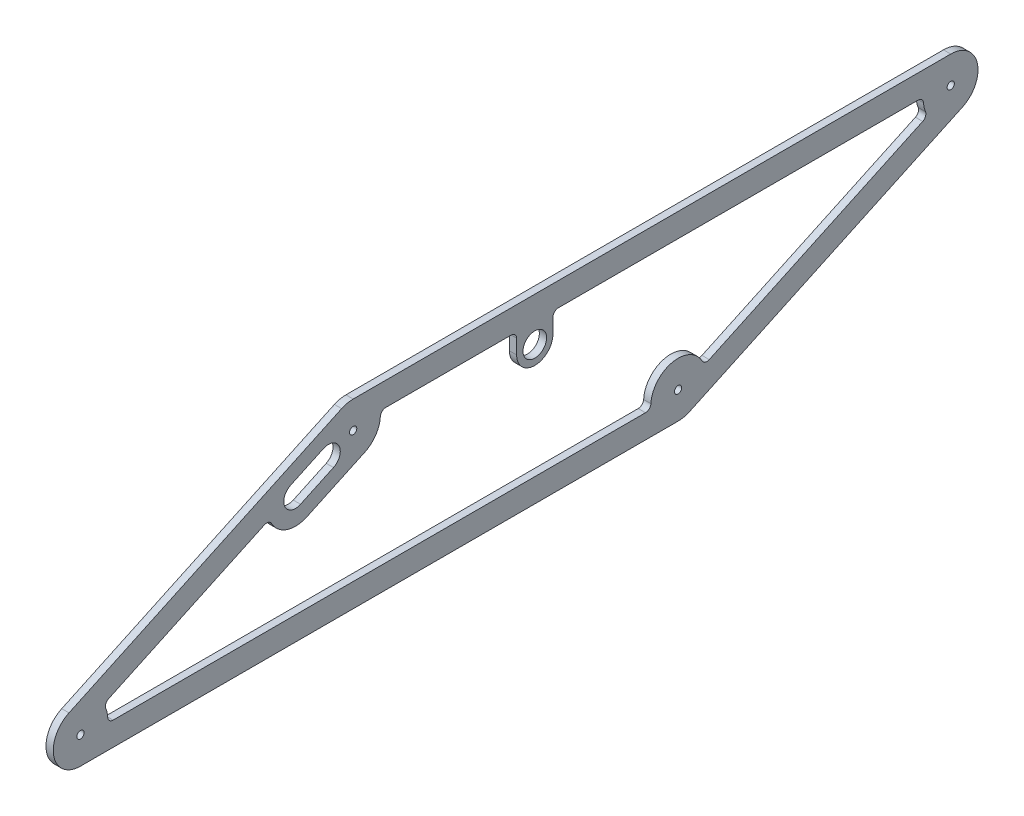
from build123d import *

# Parameters (mm, degrees)
BOSS_EXTRUDE1_DEPTH = 4
SKETCH2_R           = 2
CUT_EXTRUDE1_DEPTH  = 34
SKETCH3_R           = 2
CUT_EXTRUDE2_DEPTH  = 34
CUT_EXTRUDE3_START  = -34
CUT_EXTRUDE3_DEPTH  = 34
SKETCH8_R           = 10
BOSS_EXTRUDE3_DEPTH = 4
SKETCH5_R           = 6.5
CUT_EXTRUDE5_DEPTH  = 4
BOSS_EXTRUDE4_START = -4
BOSS_EXTRUDE4_DEPTH = 4
CUT_EXTRUDE6_DEPTH  = 4
SKETCH11_R          = 2
CUT_EXTRUDE7_DEPTH  = 10
FILLET1_R           = 3


with BuildPart() as part:
    # Sketch1 → Boss-Extrude1 (new body)
    with BuildSketch(Plane(origin=(0, 0, 0), x_dir=(0, 0, -1), z_dir=(1, 0, 0))):
        with BuildLine():
            Line((-3.32541994, 0), (-332.339372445, 0))
            ThreePointArc((-332.339372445, 0), (-346.983812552, 11.753405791), (-338.678646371, 28.594616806))
            Line((-338.678646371, 28.594616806), (-188.563161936, 98.594616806))
            ThreePointArc((-188.563161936, 98.594616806), (-185.470482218, 99.644440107), (-182.223888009, 100))
            Line((-182.223888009, 100), (146.790064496, 100))
            ThreePointArc((146.790064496, 100), (161.434504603, 88.246594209), (153.129338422, 71.405383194))
            Line((153.129338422, 71.405383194), (3.013853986, 1.405383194))
            ThreePointArc((3.013853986, 1.405383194), (-0.078825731, 0.355559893), (-3.32541994, 0))
        make_face()
    extrude(amount=BOSS_EXTRUDE1_DEPTH)

    # Sketch2 → Cut-Extrude1 (cut)
    with BuildSketch(Plane(origin=(4, 0, 0), x_dir=(0, 0, -1), z_dir=(1, 0, 0))):
        with Locations((-332.339372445, 15)):
            Circle(SKETCH2_R)
    extrude(amount=-CUT_EXTRUDE1_DEPTH, mode=Mode.SUBTRACT)

    # Sketch3 → Cut-Extrude2 (cut)
    with BuildSketch(Plane.ZY):
        with Locations((182.223888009, 85)):
            Circle(SKETCH3_R)
    extrude(amount=-CUT_EXTRUDE2_DEPTH, mode=Mode.SUBTRACT)

    # Sketch4 → Cut-Extrude3 (cut)
    with BuildSketch(Plane(origin=(4, 0, 0), x_dir=(0, 0, -1), z_dir=(1, 0, 0)).offset(CUT_EXTRUDE3_START)):
        with BuildLine():
            ThreePointArc((-18.191488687, 13), (-6.572014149, 29.644440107), (10.993050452, 19.470056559))
            Line((10.993050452, 19.470056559), (134.162067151, 76.904712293))
            ThreePointArc((134.162067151, 76.904712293), (132.145624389, 81.753405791), (131.923995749, 87))
            Line((131.923995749, 87), (-167.357819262, 87))
            ThreePointArc((-167.357819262, 87), (-167.257408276, 86.002239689), (-167.223888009, 85))
            ThreePointArc((-167.223888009, 85), (-179.963031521, 70.171361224), (-196.542358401, 80.529943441))
            Line((-196.542358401, 80.529943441), (-319.7113751, 23.095287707))
            ThreePointArc((-319.7113751, 23.095287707), (-317.944582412, 19.217821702), (-317.339372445, 15))
            ThreePointArc((-317.339372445, 15), (-317.372892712, 13.997760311), (-317.473303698, 13))
            Line((-317.473303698, 13), (-18.191488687, 13))
        make_face()
    extrude(amount=CUT_EXTRUDE3_DEPTH, mode=Mode.SUBTRACT)

    # Sketch8 → Boss-Extrude3 (add)
    with BuildSketch(Plane(origin=(4, 0, 0), x_dir=(0, 0, -1), z_dir=(1, 0, 0))):
        with Locations((-82.223888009, 76)):
            Circle(SKETCH8_R)
        with BuildLine():
            Line((-92.223888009, 87), (-92.223888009, 76))
            ThreePointArc((-92.223888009, 76), (-82.223888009, 86), (-72.223888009, 76))
            Line((-72.223888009, 76), (-72.223888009, 87))
            Line((-72.223888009, 87), (-92.223888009, 87))
        make_face()
    extrude(amount=-BOSS_EXTRUDE3_DEPTH)

    # Sketch5 → Cut-Extrude5 (cut)
    with BuildSketch(Plane(origin=(4, 0, 0), x_dir=(0, 0, -1), z_dir=(1, 0, 0))):
        with Locations((-82.223888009, 76)):
            Circle(SKETCH5_R)
    extrude(amount=-CUT_EXTRUDE5_DEPTH, mode=Mode.SUBTRACT)

    # Sketch9 → Boss-Extrude4 (add)
    with BuildSketch(Plane(origin=(4, 0, 0), x_dir=(0, 0, -1), z_dir=(1, 0, 0)).offset(BOSS_EXTRUDE4_START)):
        with BuildLine():
            ThreePointArc((-228.263130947, 65.73830428), (-220.00529534, 56.487256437), (-207.60538663, 56.613744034))
            ThreePointArc((-207.60538663, 56.613744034), (-201.293788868, 62.148866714), (-198.944660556, 70.208360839))
            ThreePointArc((-198.944660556, 70.208360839), (-199.549870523, 74.426182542), (-201.316663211, 78.303648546))
            Line((-201.316663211, 78.303648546), (-228.263130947, 65.73830428))
        make_face()
        with BuildLine():
            ThreePointArc((-220.283934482, 83.802977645), (-227.665764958, 76.268995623), (-228.263130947, 65.73830428))
            Line((-228.263130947, 65.73830428), (-201.316663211, 78.303648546))
            ThreePointArc((-201.316663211, 78.303648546), (-209.767620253, 84.615037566), (-220.283934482, 83.802977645))
        make_face()
        with BuildLine():
            ThreePointArc((-198.944660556, 70.208360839), (-201.293788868, 62.148866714), (-207.60538663, 56.613744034))
            Line((-207.60538663, 56.613744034), (-175.884614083, 71.405383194))
            ThreePointArc((-175.884614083, 71.405383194), (-188.284522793, 71.278895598), (-196.542358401, 80.529943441))
            Line((-196.542358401, 80.529943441), (-201.316663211, 78.303648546))
            ThreePointArc((-201.316663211, 78.303648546), (-199.549870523, 74.426182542), (-198.944660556, 70.208360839))
        make_face()
    extrude(amount=BOSS_EXTRUDE4_DEPTH)

    # Sketch10 → Cut-Extrude6 (cut)
    with BuildSketch(Plane(origin=(4, 0, 0), x_dir=(0, 0, -1), z_dir=(1, 0, 0))):
        with BuildLine():
            Line((-216.691679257, 76.099361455), (-198.565523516, 84.55172669))
            ThreePointArc((-198.565523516, 84.55172669), (-189.927504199, 81.407744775), (-193.071486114, 72.769725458))
            Line((-193.071486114, 72.769725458), (-211.197641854, 64.317360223))
            ThreePointArc((-211.197641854, 64.317360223), (-219.835661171, 67.461342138), (-216.691679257, 76.099361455))
        make_face()
    extrude(amount=-CUT_EXTRUDE6_DEPTH, mode=Mode.SUBTRACT)

    # Sketch11 → Cut-Extrude7 (cut)
    with BuildSketch(Plane.ZY):
        with Locations((3.32541994, 15)):
            Circle(SKETCH11_R)
        with Locations((-146.790064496, 85)):
            Circle(SKETCH11_R)
    extrude(amount=-CUT_EXTRUDE7_DEPTH, mode=Mode.SUBTRACT)

    # Fillet1
    fillet1_edges = [part.edges().sort_by_distance(p)[0] for p in [
        (2, 65.73830428, 228.263130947),
        (2, 19.470056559, -10.993050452),
        (2, 13, 18.191488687),
        (2, 13, 317.473303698),
        (2, 23.095287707, 319.7113751),
        (2, 87, 167.357819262),
        (2, 87, -131.923995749),
        (2, 76.904712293, -134.162067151),
        (2, 87, 92.223888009),
        (2, 87, 72.223888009),
    ]]
    fillet(fillet1_edges, radius=FILLET1_R)


solid = part.part
